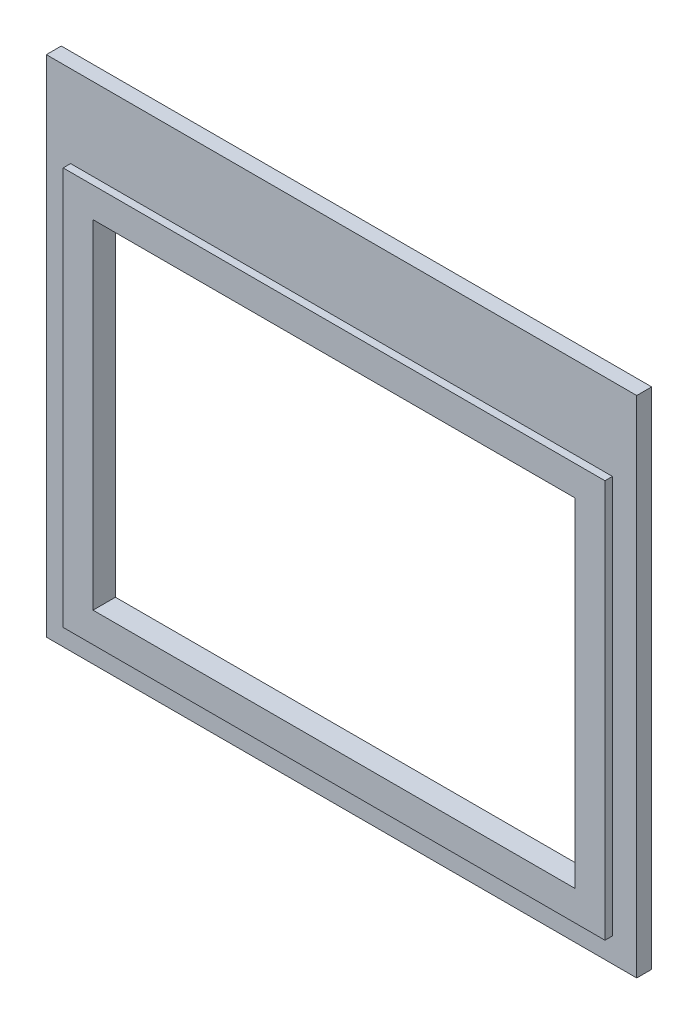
from build123d import *

# Parameters (mm, degrees)
ESQUISSE1_W             = 158
ESQUISSE1_H             = 135
BOSS_EXTRU_1_DEPTH      = 6
ENL_V_MAT_EXTRU_3_DEPTH = 2
ESQUISSE6_W             = 145
ESQUISSE6_H             = 22
ENL_V_MAT_EXTRU_4_DEPTH = 2
ESQUISSE7_W             = 129
ESQUISSE7_H             = 90.5
ENL_V_MAT_EXTRU_5_DEPTH = 122.433270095


with BuildPart() as part:
    # Esquisse1 → Boss.-Extru.1 (new body)
    with BuildSketch(Plane.XY):
        with Locations((-19.528632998, 3.225862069)):
            Rectangle(ESQUISSE1_W, ESQUISSE1_H)
    extrude(amount=BOSS_EXTRU_1_DEPTH)

    # Esquisse5 → Enl_v. mat.-Extru.3 (cut)
    with BuildSketch(Plane.XY.offset(6)):
        Polygon((59.471367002, 70.725862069), (59.471367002, -64.274137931), (-98.528632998, -64.274137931), (-98.528632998, 70.725862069), (-92.028632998, 70.725862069), (-92.028632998, -57.774137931), (52.971367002, -57.774137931), (52.971367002, 70.725862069), align=None)
    extrude(amount=-ENL_V_MAT_EXTRU_3_DEPTH, mode=Mode.SUBTRACT)

    # Esquisse6 → Enl_v. mat.-Extru.4 (cut)
    with BuildSketch(Plane.XY.offset(6)):
        with Locations((-19.528632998, 59.725862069)):
            Rectangle(ESQUISSE6_W, ESQUISSE6_H)
    extrude(amount=-ENL_V_MAT_EXTRU_4_DEPTH, mode=Mode.SUBTRACT)

    # Esquisse7 → Enl_v. mat.-Extru.5 (cut, through all)
    with BuildSketch(Plane.XY.offset(6)):
        with Locations((-19.528632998, -4.524137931)):
            Rectangle(ESQUISSE7_W, ESQUISSE7_H)
    extrude(amount=-ENL_V_MAT_EXTRU_5_DEPTH, mode=Mode.SUBTRACT)


solid = part.part
